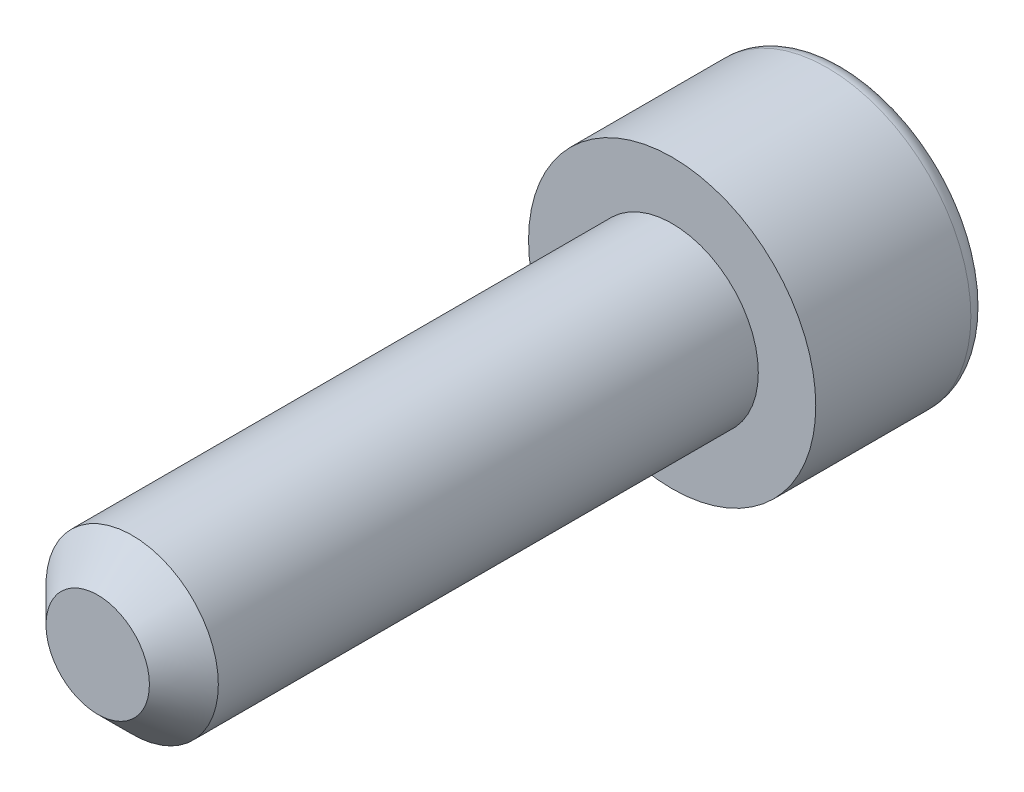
ISO-10303-21;
HEADER;
FILE_DESCRIPTION(('STEP AP214'),'2;1');
FILE_NAME('part.step','',(''),(''),'','','');
FILE_SCHEMA(('AUTOMOTIVE_DESIGN { 1 0 10303 214 1 1 1 1 }'));
ENDSEC;
DATA;
#1=APPLICATION_CONTEXT('core data for automotive mechanical design processes');
#2=APPLICATION_PROTOCOL_DEFINITION('international standard','automotive_design',2000,#1);
#3=PRODUCT_CONTEXT('',#1,'mechanical');
#4=PRODUCT('Part','Part','',(#3));
#5=PRODUCT_RELATED_PRODUCT_CATEGORY('part','',(#4));
#6=PRODUCT_DEFINITION_FORMATION('','',#4);
#7=PRODUCT_DEFINITION_CONTEXT('part definition',#1,'design');
#8=PRODUCT_DEFINITION('design','',#6,#7);
#9=PRODUCT_DEFINITION_SHAPE('','',#8);
#10=(LENGTH_UNIT() NAMED_UNIT(*) SI_UNIT(.MILLI.,.METRE.));
#11=(NAMED_UNIT(*) PLANE_ANGLE_UNIT() SI_UNIT($,.RADIAN.));
#12=(NAMED_UNIT(*) SI_UNIT($,.STERADIAN.) SOLID_ANGLE_UNIT());
#13=UNCERTAINTY_MEASURE_WITH_UNIT(LENGTH_MEASURE(1.E-05),#10,'distance_accuracy_value','');
#14=(GEOMETRIC_REPRESENTATION_CONTEXT(3) GLOBAL_UNCERTAINTY_ASSIGNED_CONTEXT((#13)) GLOBAL_UNIT_ASSIGNED_CONTEXT((#10,
#11,#12)) REPRESENTATION_CONTEXT('',''));
#15=CARTESIAN_POINT('',(0.,0.,0.));
#16=DIRECTION('',(0.,0.,1.));
#17=DIRECTION('',(1.,0.,0.));
#18=AXIS2_PLACEMENT_3D('',#15,#16,#17);
#19=CARTESIAN_POINT('',(0.,0.,-6.));
#20=DIRECTION('',(0.,0.,1.));
#21=DIRECTION('',(1.,0.,0.));
#22=AXIS2_PLACEMENT_3D('',#19,#20,#21);
#23=PLANE('',#22);
#24=CARTESIAN_POINT('',(0.,0.,-6.));
#25=DIRECTION('',(0.,0.,-1.));
#26=DIRECTION('',(-1.,0.,0.));
#27=AXIS2_PLACEMENT_3D('',#24,#25,#26);
#28=CIRCLE('',#27,4.4);
#29=CARTESIAN_POINT('',(-4.4,0.,-6.));
#30=VERTEX_POINT('',#29);
#31=EDGE_CURVE('E460',#30,#30,#28,.T.);
#32=ORIENTED_EDGE('',*,*,#31,.T.);
#33=EDGE_LOOP('',(#32));
#34=FACE_BOUND('',#33,.T.);
#35=DIRECTION('',(-0.86602540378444,0.499999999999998,0.));
#36=VECTOR('',#35,1.);
#37=CARTESIAN_POINT('',(0.,2.88675134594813,-6.));
#38=LINE('',#37,#36);
#39=CARTESIAN_POINT('',(2.5,1.44337567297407,-6.));
#40=VERTEX_POINT('',#39);
#41=CARTESIAN_POINT('',(0.,2.88675134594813,-6.));
#42=VERTEX_POINT('',#41);
#43=EDGE_CURVE('E364',#40,#42,#38,.T.);
#44=ORIENTED_EDGE('',*,*,#43,.T.);
#45=DIRECTION('',(-0.866025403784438,-0.500000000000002,0.));
#46=VECTOR('',#45,1.);
#47=CARTESIAN_POINT('',(0.,2.88675134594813,-6.));
#48=LINE('',#47,#46);
#49=CARTESIAN_POINT('',(-2.5,1.44337567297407,-6.));
#50=VERTEX_POINT('',#49);
#51=EDGE_CURVE('E404',#42,#50,#48,.T.);
#52=ORIENTED_EDGE('',*,*,#51,.T.);
#53=DIRECTION('',(0.,-1.,0.));
#54=VECTOR('',#53,1.);
#55=CARTESIAN_POINT('',(-2.5,-1.44337567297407,-6.));
#56=LINE('',#55,#54);
#57=CARTESIAN_POINT('',(-2.5,-1.44337567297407,-6.));
#58=VERTEX_POINT('',#57);
#59=EDGE_CURVE('E412',#50,#58,#56,.T.);
#60=ORIENTED_EDGE('',*,*,#59,.T.);
#61=DIRECTION('',(0.866025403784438,-0.500000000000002,0.));
#62=VECTOR('',#61,1.);
#63=CARTESIAN_POINT('',(0.,-2.88675134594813,-6.));
#64=LINE('',#63,#62);
#65=CARTESIAN_POINT('',(0.,-2.88675134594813,-6.));
#66=VERTEX_POINT('',#65);
#67=EDGE_CURVE('E430',#58,#66,#64,.T.);
#68=ORIENTED_EDGE('',*,*,#67,.T.);
#69=DIRECTION('',(0.86602540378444,0.499999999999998,0.));
#70=VECTOR('',#69,1.);
#71=CARTESIAN_POINT('',(0.,-2.88675134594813,-6.));
#72=LINE('',#71,#70);
#73=CARTESIAN_POINT('',(2.5,-1.44337567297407,-6.));
#74=VERTEX_POINT('',#73);
#75=EDGE_CURVE('E433',#66,#74,#72,.T.);
#76=ORIENTED_EDGE('',*,*,#75,.T.);
#77=DIRECTION('',(0.,1.,0.));
#78=VECTOR('',#77,1.);
#79=CARTESIAN_POINT('',(2.5,-1.44337567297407,-6.));
#80=LINE('',#79,#78);
#81=EDGE_CURVE('E423',#74,#40,#80,.T.);
#82=ORIENTED_EDGE('',*,*,#81,.T.);
#83=EDGE_LOOP('',(#44,#52,#60,#68,#76,#82));
#84=FACE_BOUND('',#83,.T.);
#85=ADVANCED_FACE('F350',(#34,#84),#23,.F.);
#86=CARTESIAN_POINT('',(0.,0.,-5.4));
#87=DIRECTION('',(0.,0.,-1.));
#88=DIRECTION('',(-1.,0.,0.));
#89=AXIS2_PLACEMENT_3D('',#86,#87,#88);
#90=TOROIDAL_SURFACE('',#89,4.4,0.6);
#91=ORIENTED_EDGE('',*,*,#31,.F.);
#92=EDGE_LOOP('',(#91));
#93=FACE_BOUND('',#92,.T.);
#94=CARTESIAN_POINT('',(0.,0.,-5.4));
#95=DIRECTION('',(0.,0.,-1.));
#96=DIRECTION('',(-1.,0.,0.));
#97=AXIS2_PLACEMENT_3D('',#94,#95,#96);
#98=CIRCLE('',#97,5.);
#99=CARTESIAN_POINT('',(-5.,0.,-5.4));
#100=VERTEX_POINT('',#99);
#101=EDGE_CURVE('E457',#100,#100,#98,.T.);
#102=ORIENTED_EDGE('',*,*,#101,.T.);
#103=EDGE_LOOP('',(#102));
#104=FACE_BOUND('',#103,.T.);
#105=ADVANCED_FACE('F479',(#93,#104),#90,.T.);
#106=CARTESIAN_POINT('',(0.,0.,0.));
#107=DIRECTION('',(0.,0.,-1.));
#108=DIRECTION('',(-1.,0.,0.));
#109=AXIS2_PLACEMENT_3D('',#106,#107,#108);
#110=CYLINDRICAL_SURFACE('',#109,5.);
#111=ORIENTED_EDGE('',*,*,#101,.F.);
#112=EDGE_LOOP('',(#111));
#113=FACE_BOUND('',#112,.T.);
#114=CARTESIAN_POINT('',(0.,0.,0.));
#115=DIRECTION('',(0.,0.,-1.));
#116=DIRECTION('',(-1.,0.,0.));
#117=AXIS2_PLACEMENT_3D('',#114,#115,#116);
#118=CIRCLE('',#117,5.);
#119=CARTESIAN_POINT('',(-5.,0.,0.));
#120=VERTEX_POINT('',#119);
#121=EDGE_CURVE('E418',#120,#120,#118,.T.);
#122=ORIENTED_EDGE('',*,*,#121,.T.);
#123=EDGE_LOOP('',(#122));
#124=FACE_BOUND('',#123,.T.);
#125=ADVANCED_FACE('F484',(#113,#124),#110,.T.);
#126=CARTESIAN_POINT('',(0.,0.,0.));
#127=DIRECTION('',(0.,0.,-1.));
#128=DIRECTION('',(-1.,0.,0.));
#129=AXIS2_PLACEMENT_3D('',#126,#127,#128);
#130=PLANE('',#129);
#131=CARTESIAN_POINT('',(0.,0.,0.));
#132=DIRECTION('',(0.,0.,1.));
#133=DIRECTION('',(1.,0.,0.));
#134=AXIS2_PLACEMENT_3D('',#131,#132,#133);
#135=CIRCLE('',#134,3.);
#136=CARTESIAN_POINT('',(3.,0.,0.));
#137=VERTEX_POINT('',#136);
#138=EDGE_CURVE('E424',#137,#137,#135,.T.);
#139=ORIENTED_EDGE('',*,*,#138,.F.);
#140=EDGE_LOOP('',(#139));
#141=FACE_BOUND('',#140,.T.);
#142=ORIENTED_EDGE('',*,*,#121,.F.);
#143=EDGE_LOOP('',(#142));
#144=FACE_BOUND('',#143,.T.);
#145=ADVANCED_FACE('F492',(#141,#144),#130,.F.);
#146=CARTESIAN_POINT('',(0.,2.88675134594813,-3.));
#147=DIRECTION('',(-0.499999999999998,-0.86602540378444,0.));
#148=DIRECTION('',(0.86602540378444,-0.499999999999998,0.));
#149=AXIS2_PLACEMENT_3D('',#146,#147,#148);
#150=PLANE('',#149);
#151=ORIENTED_EDGE('',*,*,#43,.F.);
#152=DIRECTION('',(0.,0.,-1.));
#153=VECTOR('',#152,1.);
#154=CARTESIAN_POINT('',(2.5,1.44337567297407,-3.));
#155=LINE('',#154,#153);
#156=CARTESIAN_POINT('',(2.5,1.44337567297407,-3.));
#157=VERTEX_POINT('',#156);
#158=EDGE_CURVE('E446',#157,#40,#155,.T.);
#159=ORIENTED_EDGE('',*,*,#158,.F.);
#160=DIRECTION('',(-0.86602540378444,0.499999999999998,0.));
#161=VECTOR('',#160,1.);
#162=CARTESIAN_POINT('',(0.,2.88675134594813,-3.));
#163=LINE('',#162,#161);
#164=CARTESIAN_POINT('',(0.,2.88675134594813,-3.));
#165=VERTEX_POINT('',#164);
#166=EDGE_CURVE('E417',#157,#165,#163,.T.);
#167=ORIENTED_EDGE('',*,*,#166,.T.);
#168=DIRECTION('',(0.,0.,-1.));
#169=VECTOR('',#168,1.);
#170=CARTESIAN_POINT('',(0.,2.88675134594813,-3.));
#171=LINE('',#170,#169);
#172=EDGE_CURVE('E406',#165,#42,#171,.T.);
#173=ORIENTED_EDGE('',*,*,#172,.T.);
#174=EDGE_LOOP('',(#151,#159,#167,#173));
#175=FACE_BOUND('',#174,.T.);
#176=ADVANCED_FACE('F415',(#175),#150,.T.);
#177=CARTESIAN_POINT('',(0.,2.88675134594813,-3.));
#178=DIRECTION('',(0.500000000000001,-0.866025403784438,0.));
#179=DIRECTION('',(0.866025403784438,0.500000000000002,0.));
#180=AXIS2_PLACEMENT_3D('',#177,#178,#179);
#181=PLANE('',#180);
#182=ORIENTED_EDGE('',*,*,#51,.F.);
#183=ORIENTED_EDGE('',*,*,#172,.F.);
#184=DIRECTION('',(-0.866025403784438,-0.500000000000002,0.));
#185=VECTOR('',#184,1.);
#186=CARTESIAN_POINT('',(0.,2.88675134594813,-3.));
#187=LINE('',#186,#185);
#188=CARTESIAN_POINT('',(-2.5,1.44337567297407,-3.));
#189=VERTEX_POINT('',#188);
#190=EDGE_CURVE('E437',#165,#189,#187,.T.);
#191=ORIENTED_EDGE('',*,*,#190,.T.);
#192=DIRECTION('',(0.,0.,-1.));
#193=VECTOR('',#192,1.);
#194=CARTESIAN_POINT('',(-2.5,1.44337567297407,-3.));
#195=LINE('',#194,#193);
#196=EDGE_CURVE('E408',#189,#50,#195,.T.);
#197=ORIENTED_EDGE('',*,*,#196,.T.);
#198=EDGE_LOOP('',(#182,#183,#191,#197));
#199=FACE_BOUND('',#198,.T.);
#200=ADVANCED_FACE('F405',(#199),#181,.T.);
#201=CARTESIAN_POINT('',(-2.5,-1.44337567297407,-3.));
#202=DIRECTION('',(1.,0.,0.));
#203=DIRECTION('',(0.,0.,-1.));
#204=AXIS2_PLACEMENT_3D('',#201,#202,#203);
#205=PLANE('',#204);
#206=ORIENTED_EDGE('',*,*,#59,.F.);
#207=ORIENTED_EDGE('',*,*,#196,.F.);
#208=DIRECTION('',(0.,-1.,0.));
#209=VECTOR('',#208,1.);
#210=CARTESIAN_POINT('',(-2.5,-1.44337567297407,-3.));
#211=LINE('',#210,#209);
#212=CARTESIAN_POINT('',(-2.5,-1.44337567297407,-3.));
#213=VERTEX_POINT('',#212);
#214=EDGE_CURVE('E439',#189,#213,#211,.T.);
#215=ORIENTED_EDGE('',*,*,#214,.T.);
#216=DIRECTION('',(0.,0.,-1.));
#217=VECTOR('',#216,1.);
#218=CARTESIAN_POINT('',(-2.5,-1.44337567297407,-3.));
#219=LINE('',#218,#217);
#220=EDGE_CURVE('E452',#213,#58,#219,.T.);
#221=ORIENTED_EDGE('',*,*,#220,.T.);
#222=EDGE_LOOP('',(#206,#207,#215,#221));
#223=FACE_BOUND('',#222,.T.);
#224=ADVANCED_FACE('F507',(#223),#205,.T.);
#225=CARTESIAN_POINT('',(0.,-2.88675134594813,-3.));
#226=DIRECTION('',(0.500000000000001,0.866025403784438,0.));
#227=DIRECTION('',(-0.866025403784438,0.500000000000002,0.));
#228=AXIS2_PLACEMENT_3D('',#225,#226,#227);
#229=PLANE('',#228);
#230=ORIENTED_EDGE('',*,*,#67,.F.);
#231=ORIENTED_EDGE('',*,*,#220,.F.);
#232=DIRECTION('',(0.866025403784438,-0.500000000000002,0.));
#233=VECTOR('',#232,1.);
#234=CARTESIAN_POINT('',(0.,-2.88675134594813,-3.));
#235=LINE('',#234,#233);
#236=CARTESIAN_POINT('',(0.,-2.88675134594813,-3.));
#237=VERTEX_POINT('',#236);
#238=EDGE_CURVE('E441',#213,#237,#235,.T.);
#239=ORIENTED_EDGE('',*,*,#238,.T.);
#240=DIRECTION('',(0.,0.,-1.));
#241=VECTOR('',#240,1.);
#242=CARTESIAN_POINT('',(0.,-2.88675134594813,-3.));
#243=LINE('',#242,#241);
#244=EDGE_CURVE('E450',#237,#66,#243,.T.);
#245=ORIENTED_EDGE('',*,*,#244,.T.);
#246=EDGE_LOOP('',(#230,#231,#239,#245));
#247=FACE_BOUND('',#246,.T.);
#248=ADVANCED_FACE('F510',(#247),#229,.T.);
#249=CARTESIAN_POINT('',(0.,-2.88675134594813,-3.));
#250=DIRECTION('',(-0.499999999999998,0.86602540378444,0.));
#251=DIRECTION('',(-0.86602540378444,-0.499999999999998,0.));
#252=AXIS2_PLACEMENT_3D('',#249,#250,#251);
#253=PLANE('',#252);
#254=ORIENTED_EDGE('',*,*,#75,.F.);
#255=ORIENTED_EDGE('',*,*,#244,.F.);
#256=DIRECTION('',(0.86602540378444,0.499999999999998,0.));
#257=VECTOR('',#256,1.);
#258=CARTESIAN_POINT('',(0.,-2.88675134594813,-3.));
#259=LINE('',#258,#257);
#260=CARTESIAN_POINT('',(2.5,-1.44337567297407,-3.));
#261=VERTEX_POINT('',#260);
#262=EDGE_CURVE('E443',#237,#261,#259,.T.);
#263=ORIENTED_EDGE('',*,*,#262,.T.);
#264=DIRECTION('',(0.,0.,-1.));
#265=VECTOR('',#264,1.);
#266=CARTESIAN_POINT('',(2.5,-1.44337567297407,-3.));
#267=LINE('',#266,#265);
#268=EDGE_CURVE('E448',#261,#74,#267,.T.);
#269=ORIENTED_EDGE('',*,*,#268,.T.);
#270=EDGE_LOOP('',(#254,#255,#263,#269));
#271=FACE_BOUND('',#270,.T.);
#272=ADVANCED_FACE('F514',(#271),#253,.T.);
#273=CARTESIAN_POINT('',(2.5,-1.44337567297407,-3.));
#274=DIRECTION('',(-1.,0.,0.));
#275=DIRECTION('',(0.,0.,1.));
#276=AXIS2_PLACEMENT_3D('',#273,#274,#275);
#277=PLANE('',#276);
#278=ORIENTED_EDGE('',*,*,#81,.F.);
#279=ORIENTED_EDGE('',*,*,#268,.F.);
#280=DIRECTION('',(0.,1.,0.));
#281=VECTOR('',#280,1.);
#282=CARTESIAN_POINT('',(2.5,-1.44337567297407,-3.));
#283=LINE('',#282,#281);
#284=EDGE_CURVE('E371',#261,#157,#283,.T.);
#285=ORIENTED_EDGE('',*,*,#284,.T.);
#286=ORIENTED_EDGE('',*,*,#158,.T.);
#287=EDGE_LOOP('',(#278,#279,#285,#286));
#288=FACE_BOUND('',#287,.T.);
#289=ADVANCED_FACE('F518',(#288),#277,.T.);
#290=CARTESIAN_POINT('',(2.5,1.44337567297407,-3.));
#291=DIRECTION('',(0.,0.,1.));
#292=DIRECTION('',(1.,0.,0.));
#293=AXIS2_PLACEMENT_3D('',#290,#291,#292);
#294=PLANE('',#293);
#295=ORIENTED_EDGE('',*,*,#166,.F.);
#296=ORIENTED_EDGE('',*,*,#284,.F.);
#297=ORIENTED_EDGE('',*,*,#262,.F.);
#298=ORIENTED_EDGE('',*,*,#238,.F.);
#299=ORIENTED_EDGE('',*,*,#214,.F.);
#300=ORIENTED_EDGE('',*,*,#190,.F.);
#301=EDGE_LOOP('',(#295,#296,#297,#298,#299,#300));
#302=FACE_BOUND('',#301,.T.);
#303=ADVANCED_FACE('F522',(#302),#294,.F.);
#304=CARTESIAN_POINT('',(0.,0.,20.));
#305=DIRECTION('',(0.,0.,1.));
#306=DIRECTION('',(1.,0.,0.));
#307=AXIS2_PLACEMENT_3D('',#304,#305,#306);
#308=PLANE('',#307);
#309=CARTESIAN_POINT('',(0.,0.,20.));
#310=DIRECTION('',(0.,0.,1.));
#311=DIRECTION('',(1.,0.,0.));
#312=AXIS2_PLACEMENT_3D('',#309,#310,#311);
#313=CIRCLE('',#312,1.79999999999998);
#314=CARTESIAN_POINT('',(1.79999999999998,0.,20.));
#315=VERTEX_POINT('',#314);
#316=EDGE_CURVE('E357',#315,#315,#313,.T.);
#317=ORIENTED_EDGE('',*,*,#316,.T.);
#318=EDGE_LOOP('',(#317));
#319=FACE_BOUND('',#318,.T.);
#320=ADVANCED_FACE('F465',(#319),#308,.T.);
#321=CARTESIAN_POINT('',(0.,0.,0.));
#322=DIRECTION('',(0.,0.,1.));
#323=DIRECTION('',(1.,0.,0.));
#324=AXIS2_PLACEMENT_3D('',#321,#322,#323);
#325=CYLINDRICAL_SURFACE('',#324,3.);
#326=CARTESIAN_POINT('',(0.,0.,18.8));
#327=DIRECTION('',(0.,0.,1.));
#328=DIRECTION('',(1.,0.,0.));
#329=AXIS2_PLACEMENT_3D('',#326,#327,#328);
#330=CIRCLE('',#329,3.);
#331=CARTESIAN_POINT('',(3.,0.,18.8));
#332=VERTEX_POINT('',#331);
#333=EDGE_CURVE('E11',#332,#332,#330,.F.);
#334=ORIENTED_EDGE('',*,*,#333,.T.);
#335=EDGE_LOOP('',(#334));
#336=FACE_BOUND('',#335,.T.);
#337=ORIENTED_EDGE('',*,*,#138,.T.);
#338=EDGE_LOOP('',(#337));
#339=FACE_BOUND('',#338,.T.);
#340=ADVANCED_FACE('F469',(#336,#339),#325,.T.);
#341=CARTESIAN_POINT('',(0.,0.,20.));
#342=DIRECTION('',(0.,0.,-1.));
#343=DIRECTION('',(-1.,0.,0.));
#344=AXIS2_PLACEMENT_3D('',#341,#342,#343);
#345=CONICAL_SURFACE('',#344,1.79999999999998,0.785398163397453);
#346=ORIENTED_EDGE('',*,*,#333,.F.);
#347=EDGE_LOOP('',(#346));
#348=FACE_BOUND('',#347,.T.);
#349=ORIENTED_EDGE('',*,*,#316,.F.);
#350=EDGE_LOOP('',(#349));
#351=FACE_BOUND('',#350,.T.);
#352=ADVANCED_FACE('F467',(#348,#351),#345,.T.);
#353=CLOSED_SHELL('',(#85,#105,#125,#145,#176,#200,#224,#248,#272,#289,#303,#320,#340,#352));
#354=MANIFOLD_SOLID_BREP('B2',#353);
#355=ADVANCED_BREP_SHAPE_REPRESENTATION('',(#18,#354),#14);
#356=SHAPE_DEFINITION_REPRESENTATION(#9,#355);
ENDSEC;
END-ISO-10303-21;
